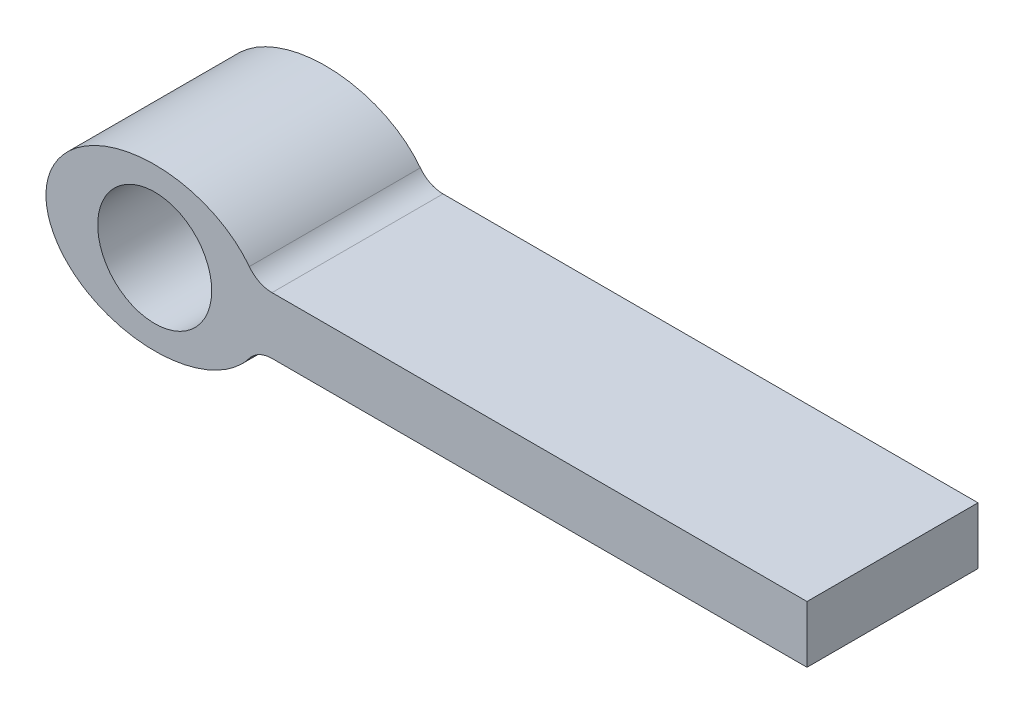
ISO-10303-21;
HEADER;
FILE_DESCRIPTION(('STEP AP214'),'2;1');
FILE_NAME('part.step','',(''),(''),'','','');
FILE_SCHEMA(('AUTOMOTIVE_DESIGN { 1 0 10303 214 1 1 1 1 }'));
ENDSEC;
DATA;
#1=APPLICATION_CONTEXT('core data for automotive mechanical design processes');
#2=APPLICATION_PROTOCOL_DEFINITION('international standard','automotive_design',2000,#1);
#3=PRODUCT_CONTEXT('',#1,'mechanical');
#4=PRODUCT('Part','Part','',(#3));
#5=PRODUCT_RELATED_PRODUCT_CATEGORY('part','',(#4));
#6=PRODUCT_DEFINITION_FORMATION('','',#4);
#7=PRODUCT_DEFINITION_CONTEXT('part definition',#1,'design');
#8=PRODUCT_DEFINITION('design','',#6,#7);
#9=PRODUCT_DEFINITION_SHAPE('','',#8);
#10=(LENGTH_UNIT() NAMED_UNIT(*) SI_UNIT(.MILLI.,.METRE.));
#11=(NAMED_UNIT(*) PLANE_ANGLE_UNIT() SI_UNIT($,.RADIAN.));
#12=(NAMED_UNIT(*) SI_UNIT($,.STERADIAN.) SOLID_ANGLE_UNIT());
#13=UNCERTAINTY_MEASURE_WITH_UNIT(LENGTH_MEASURE(1.E-05),#10,'distance_accuracy_value','');
#14=(GEOMETRIC_REPRESENTATION_CONTEXT(3) GLOBAL_UNCERTAINTY_ASSIGNED_CONTEXT((#13)) GLOBAL_UNIT_ASSIGNED_CONTEXT((#10,
#11,#12)) REPRESENTATION_CONTEXT('',''));
#15=CARTESIAN_POINT('',(0.,0.,0.));
#16=DIRECTION('',(0.,0.,1.));
#17=DIRECTION('',(1.,0.,0.));
#18=AXIS2_PLACEMENT_3D('',#15,#16,#17);
#19=CARTESIAN_POINT('',(0.,0.,6.));
#20=DIRECTION('',(0.,0.,1.));
#21=DIRECTION('',(1.,0.,0.));
#22=AXIS2_PLACEMENT_3D('',#19,#20,#21);
#23=PLANE('',#22);
#24=CARTESIAN_POINT('',(8.23309928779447,-4.,6.));
#25=DIRECTION('',(0.,0.,-1.));
#26=DIRECTION('',(1.,0.,0.));
#27=AXIS2_PLACEMENT_3D('',#24,#25,#26);
#28=CIRCLE('',#27,2.);
#29=CARTESIAN_POINT('',(6.64164029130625,-2.78869563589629,6.));
#30=VERTEX_POINT('',#29);
#31=CARTESIAN_POINT('',(8.23309928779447,-2.,6.));
#32=VERTEX_POINT('',#31);
#33=EDGE_CURVE('E162',#30,#32,#28,.T.);
#34=ORIENTED_EDGE('',*,*,#33,.T.);
#35=DIRECTION('',(1.,0.,0.));
#36=VECTOR('',#35,1.);
#37=CARTESIAN_POINT('',(45.7767491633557,-2.,6.));
#38=LINE('',#37,#36);
#39=CARTESIAN_POINT('',(45.7767491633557,-2.,6.));
#40=VERTEX_POINT('',#39);
#41=EDGE_CURVE('E86',#32,#40,#38,.T.);
#42=ORIENTED_EDGE('',*,*,#41,.T.);
#43=DIRECTION('',(0.,1.,0.));
#44=VECTOR('',#43,1.);
#45=CARTESIAN_POINT('',(45.7767491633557,2.,6.));
#46=LINE('',#45,#44);
#47=CARTESIAN_POINT('',(45.7767491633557,2.,6.));
#48=VERTEX_POINT('',#47);
#49=EDGE_CURVE('E99',#40,#48,#46,.T.);
#50=ORIENTED_EDGE('',*,*,#49,.T.);
#51=DIRECTION('',(-1.,0.,0.));
#52=VECTOR('',#51,1.);
#53=CARTESIAN_POINT('',(8.23309928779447,2.,6.));
#54=LINE('',#53,#52);
#55=CARTESIAN_POINT('',(8.23309928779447,2.,6.));
#56=VERTEX_POINT('',#55);
#57=EDGE_CURVE('E93',#48,#56,#54,.T.);
#58=ORIENTED_EDGE('',*,*,#57,.T.);
#59=CARTESIAN_POINT('',(8.23309928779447,4.,6.));
#60=DIRECTION('',(0.,0.,-1.));
#61=DIRECTION('',(-1.,0.,0.));
#62=AXIS2_PLACEMENT_3D('',#59,#60,#61);
#63=CIRCLE('',#62,2.);
#64=CARTESIAN_POINT('',(6.64164029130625,2.78869563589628,6.));
#65=VERTEX_POINT('',#64);
#66=EDGE_CURVE('E97',#56,#65,#63,.T.);
#67=ORIENTED_EDGE('',*,*,#66,.T.);
#68=CARTESIAN_POINT('',(0.,0.,6.));
#69=DIRECTION('',(0.,0.,1.));
#70=DIRECTION('',(-1.,0.,0.));
#71=AXIS2_PLACEMENT_3D('',#68,#69,#70);
#72=ELLIPSE('',#71,7.62945819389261,5.66666666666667);
#73=EDGE_CURVE('E49',#65,#30,#72,.T.);
#74=ORIENTED_EDGE('',*,*,#73,.T.);
#75=EDGE_LOOP('',(#34,#42,#50,#58,#67,#74));
#76=FACE_BOUND('',#75,.T.);
#77=CARTESIAN_POINT('',(0.,0.,6.));
#78=DIRECTION('',(0.,0.,1.));
#79=DIRECTION('',(1.,0.,0.));
#80=AXIS2_PLACEMENT_3D('',#77,#78,#79);
#81=CIRCLE('',#80,4.);
#82=CARTESIAN_POINT('',(4.,0.,6.));
#83=VERTEX_POINT('',#82);
#84=EDGE_CURVE('E154',#83,#83,#81,.T.);
#85=ORIENTED_EDGE('',*,*,#84,.F.);
#86=EDGE_LOOP('',(#85));
#87=FACE_BOUND('',#86,.T.);
#88=ADVANCED_FACE('F32',(#76,#87),#23,.T.);
#89=CARTESIAN_POINT('',(0.,0.,-6.));
#90=DIRECTION('',(0.,0.,1.));
#91=DIRECTION('',(1.,0.,0.));
#92=AXIS2_PLACEMENT_3D('',#89,#90,#91);
#93=PLANE('',#92);
#94=CARTESIAN_POINT('',(8.23309928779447,-4.,-6.));
#95=DIRECTION('',(0.,0.,-1.));
#96=DIRECTION('',(1.,0.,0.));
#97=AXIS2_PLACEMENT_3D('',#94,#95,#96);
#98=CIRCLE('',#97,2.);
#99=CARTESIAN_POINT('',(6.64164029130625,-2.78869563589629,-6.));
#100=VERTEX_POINT('',#99);
#101=CARTESIAN_POINT('',(8.23309928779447,-2.,-6.));
#102=VERTEX_POINT('',#101);
#103=EDGE_CURVE('E118',#100,#102,#98,.T.);
#104=ORIENTED_EDGE('',*,*,#103,.F.);
#105=CARTESIAN_POINT('',(0.,0.,-6.));
#106=DIRECTION('',(0.,0.,1.));
#107=DIRECTION('',(-1.,0.,0.));
#108=AXIS2_PLACEMENT_3D('',#105,#106,#107);
#109=ELLIPSE('',#108,7.62945819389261,5.66666666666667);
#110=CARTESIAN_POINT('',(6.64164029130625,2.78869563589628,-6.));
#111=VERTEX_POINT('',#110);
#112=EDGE_CURVE('E78',#111,#100,#109,.T.);
#113=ORIENTED_EDGE('',*,*,#112,.F.);
#114=CARTESIAN_POINT('',(8.23309928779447,4.,-6.));
#115=DIRECTION('',(0.,0.,-1.));
#116=DIRECTION('',(-1.,0.,0.));
#117=AXIS2_PLACEMENT_3D('',#114,#115,#116);
#118=CIRCLE('',#117,2.);
#119=CARTESIAN_POINT('',(8.23309928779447,2.,-6.));
#120=VERTEX_POINT('',#119);
#121=EDGE_CURVE('E72',#120,#111,#118,.T.);
#122=ORIENTED_EDGE('',*,*,#121,.F.);
#123=DIRECTION('',(-1.,0.,0.));
#124=VECTOR('',#123,1.);
#125=CARTESIAN_POINT('',(8.23309928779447,2.,-6.));
#126=LINE('',#125,#124);
#127=CARTESIAN_POINT('',(45.7767491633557,2.,-6.));
#128=VERTEX_POINT('',#127);
#129=EDGE_CURVE('E107',#128,#120,#126,.T.);
#130=ORIENTED_EDGE('',*,*,#129,.F.);
#131=DIRECTION('',(0.,1.,0.));
#132=VECTOR('',#131,1.);
#133=CARTESIAN_POINT('',(45.7767491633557,2.,-6.));
#134=LINE('',#133,#132);
#135=CARTESIAN_POINT('',(45.7767491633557,-2.,-6.));
#136=VERTEX_POINT('',#135);
#137=EDGE_CURVE('E169',#136,#128,#134,.T.);
#138=ORIENTED_EDGE('',*,*,#137,.F.);
#139=DIRECTION('',(1.,0.,0.));
#140=VECTOR('',#139,1.);
#141=CARTESIAN_POINT('',(45.7767491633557,-2.,-6.));
#142=LINE('',#141,#140);
#143=EDGE_CURVE('E167',#102,#136,#142,.T.);
#144=ORIENTED_EDGE('',*,*,#143,.F.);
#145=EDGE_LOOP('',(#104,#113,#122,#130,#138,#144));
#146=FACE_BOUND('',#145,.T.);
#147=CARTESIAN_POINT('',(0.,0.,-6.));
#148=DIRECTION('',(0.,0.,1.));
#149=DIRECTION('',(1.,0.,0.));
#150=AXIS2_PLACEMENT_3D('',#147,#148,#149);
#151=CIRCLE('',#150,4.);
#152=CARTESIAN_POINT('',(4.,0.,-6.));
#153=VERTEX_POINT('',#152);
#154=EDGE_CURVE('E157',#153,#153,#151,.T.);
#155=ORIENTED_EDGE('',*,*,#154,.T.);
#156=EDGE_LOOP('',(#155));
#157=FACE_BOUND('',#156,.T.);
#158=ADVANCED_FACE('F126',(#146,#157),#93,.F.);
#159=CARTESIAN_POINT('',(8.23309928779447,-4.,6.));
#160=DIRECTION('',(0.,0.,-1.));
#161=DIRECTION('',(-1.,0.,0.));
#162=AXIS2_PLACEMENT_3D('',#159,#160,#161);
#163=CYLINDRICAL_SURFACE('',#162,2.);
#164=ORIENTED_EDGE('',*,*,#103,.T.);
#165=DIRECTION('',(0.,0.,-1.));
#166=VECTOR('',#165,1.);
#167=CARTESIAN_POINT('',(8.23309928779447,-2.,6.));
#168=LINE('',#167,#166);
#169=EDGE_CURVE('E11',#32,#102,#168,.T.);
#170=ORIENTED_EDGE('',*,*,#169,.F.);
#171=ORIENTED_EDGE('',*,*,#33,.F.);
#172=DIRECTION('',(0.,0.,-1.));
#173=VECTOR('',#172,1.);
#174=CARTESIAN_POINT('',(6.64164029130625,-2.78869563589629,6.));
#175=LINE('',#174,#173);
#176=EDGE_CURVE('E113',#30,#100,#175,.T.);
#177=ORIENTED_EDGE('',*,*,#176,.T.);
#178=EDGE_LOOP('',(#164,#170,#171,#177));
#179=FACE_BOUND('',#178,.T.);
#180=ADVANCED_FACE('F34',(#179),#163,.F.);
#181=CARTESIAN_POINT('',(45.7767491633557,-2.,6.));
#182=DIRECTION('',(0.,1.,0.));
#183=DIRECTION('',(0.,0.,1.));
#184=AXIS2_PLACEMENT_3D('',#181,#182,#183);
#185=PLANE('',#184);
#186=ORIENTED_EDGE('',*,*,#143,.T.);
#187=DIRECTION('',(0.,0.,-1.));
#188=VECTOR('',#187,1.);
#189=CARTESIAN_POINT('',(45.7767491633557,-2.,6.));
#190=LINE('',#189,#188);
#191=EDGE_CURVE('E41',#40,#136,#190,.T.);
#192=ORIENTED_EDGE('',*,*,#191,.F.);
#193=ORIENTED_EDGE('',*,*,#41,.F.);
#194=ORIENTED_EDGE('',*,*,#169,.T.);
#195=EDGE_LOOP('',(#186,#192,#193,#194));
#196=FACE_BOUND('',#195,.T.);
#197=ADVANCED_FACE('F134',(#196),#185,.F.);
#198=CARTESIAN_POINT('',(45.7767491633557,2.,6.));
#199=DIRECTION('',(-1.,0.,0.));
#200=DIRECTION('',(0.,0.,1.));
#201=AXIS2_PLACEMENT_3D('',#198,#199,#200);
#202=PLANE('',#201);
#203=ORIENTED_EDGE('',*,*,#137,.T.);
#204=DIRECTION('',(0.,0.,-1.));
#205=VECTOR('',#204,1.);
#206=CARTESIAN_POINT('',(45.7767491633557,2.,6.));
#207=LINE('',#206,#205);
#208=EDGE_CURVE('E108',#48,#128,#207,.T.);
#209=ORIENTED_EDGE('',*,*,#208,.F.);
#210=ORIENTED_EDGE('',*,*,#49,.F.);
#211=ORIENTED_EDGE('',*,*,#191,.T.);
#212=EDGE_LOOP('',(#203,#209,#210,#211));
#213=FACE_BOUND('',#212,.T.);
#214=ADVANCED_FACE('F132',(#213),#202,.F.);
#215=CARTESIAN_POINT('',(8.23309928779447,2.,6.));
#216=DIRECTION('',(0.,-1.,0.));
#217=DIRECTION('',(0.,0.,-1.));
#218=AXIS2_PLACEMENT_3D('',#215,#216,#217);
#219=PLANE('',#218);
#220=ORIENTED_EDGE('',*,*,#129,.T.);
#221=DIRECTION('',(0.,0.,-1.));
#222=VECTOR('',#221,1.);
#223=CARTESIAN_POINT('',(8.23309928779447,2.,6.));
#224=LINE('',#223,#222);
#225=EDGE_CURVE('E104',#56,#120,#224,.T.);
#226=ORIENTED_EDGE('',*,*,#225,.F.);
#227=ORIENTED_EDGE('',*,*,#57,.F.);
#228=ORIENTED_EDGE('',*,*,#208,.T.);
#229=EDGE_LOOP('',(#220,#226,#227,#228));
#230=FACE_BOUND('',#229,.T.);
#231=ADVANCED_FACE('F105',(#230),#219,.F.);
#232=CARTESIAN_POINT('',(8.23309928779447,4.,6.));
#233=DIRECTION('',(0.,0.,-1.));
#234=DIRECTION('',(-1.,0.,0.));
#235=AXIS2_PLACEMENT_3D('',#232,#233,#234);
#236=CYLINDRICAL_SURFACE('',#235,2.);
#237=ORIENTED_EDGE('',*,*,#121,.T.);
#238=DIRECTION('',(0.,0.,-1.));
#239=VECTOR('',#238,1.);
#240=CARTESIAN_POINT('',(6.64164029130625,2.78869563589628,6.));
#241=LINE('',#240,#239);
#242=EDGE_CURVE('E109',#65,#111,#241,.T.);
#243=ORIENTED_EDGE('',*,*,#242,.F.);
#244=ORIENTED_EDGE('',*,*,#66,.F.);
#245=ORIENTED_EDGE('',*,*,#225,.T.);
#246=EDGE_LOOP('',(#237,#243,#244,#245));
#247=FACE_BOUND('',#246,.T.);
#248=ADVANCED_FACE('F111',(#247),#236,.F.);
#249=DIRECTION('',(0.,0.,-1.));
#250=VECTOR('',#249,1.);
#251=SURFACE_OF_LINEAR_EXTRUSION('',#72,#250);
#252=ORIENTED_EDGE('',*,*,#112,.T.);
#253=ORIENTED_EDGE('',*,*,#176,.F.);
#254=ORIENTED_EDGE('',*,*,#73,.F.);
#255=ORIENTED_EDGE('',*,*,#242,.T.);
#256=EDGE_LOOP('',(#252,#253,#254,#255));
#257=FACE_BOUND('',#256,.T.);
#258=ADVANCED_FACE('F121',(#257),#251,.F.);
#259=CARTESIAN_POINT('',(0.,0.,6.));
#260=DIRECTION('',(0.,0.,-1.));
#261=DIRECTION('',(-1.,0.,0.));
#262=AXIS2_PLACEMENT_3D('',#259,#260,#261);
#263=CYLINDRICAL_SURFACE('',#262,4.);
#264=ORIENTED_EDGE('',*,*,#84,.T.);
#265=EDGE_LOOP('',(#264));
#266=FACE_BOUND('',#265,.T.);
#267=ORIENTED_EDGE('',*,*,#154,.F.);
#268=EDGE_LOOP('',(#267));
#269=FACE_BOUND('',#268,.T.);
#270=ADVANCED_FACE('F125',(#266,#269),#263,.F.);
#271=CLOSED_SHELL('',(#88,#158,#180,#197,#214,#231,#248,#258,#270));
#272=MANIFOLD_SOLID_BREP('B2',#271);
#273=ADVANCED_BREP_SHAPE_REPRESENTATION('',(#18,#272),#14);
#274=SHAPE_DEFINITION_REPRESENTATION(#9,#273);
ENDSEC;
END-ISO-10303-21;
